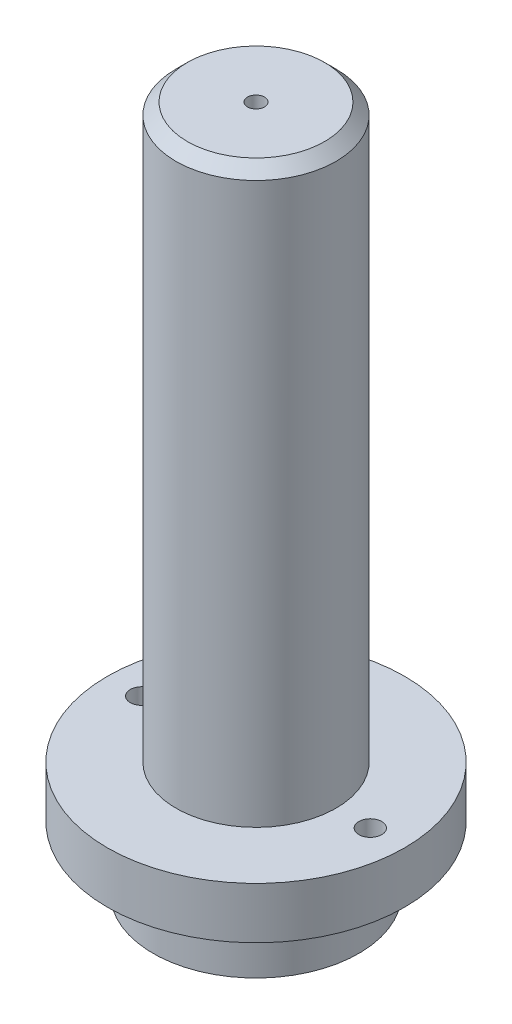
ISO-10303-21;
HEADER;
FILE_DESCRIPTION(('STEP AP214'),'2;1');
FILE_NAME('part.step','',(''),(''),'','','');
FILE_SCHEMA(('AUTOMOTIVE_DESIGN { 1 0 10303 214 1 1 1 1 }'));
ENDSEC;
DATA;
#1=APPLICATION_CONTEXT('core data for automotive mechanical design processes');
#2=APPLICATION_PROTOCOL_DEFINITION('international standard','automotive_design',2000,#1);
#3=PRODUCT_CONTEXT('',#1,'mechanical');
#4=PRODUCT('Part','Part','',(#3));
#5=PRODUCT_RELATED_PRODUCT_CATEGORY('part','',(#4));
#6=PRODUCT_DEFINITION_FORMATION('','',#4);
#7=PRODUCT_DEFINITION_CONTEXT('part definition',#1,'design');
#8=PRODUCT_DEFINITION('design','',#6,#7);
#9=PRODUCT_DEFINITION_SHAPE('','',#8);
#10=(LENGTH_UNIT() NAMED_UNIT(*) SI_UNIT(.MILLI.,.METRE.));
#11=(NAMED_UNIT(*) PLANE_ANGLE_UNIT() SI_UNIT($,.RADIAN.));
#12=(NAMED_UNIT(*) SI_UNIT($,.STERADIAN.) SOLID_ANGLE_UNIT());
#13=UNCERTAINTY_MEASURE_WITH_UNIT(LENGTH_MEASURE(1.E-05),#10,'distance_accuracy_value','');
#14=(GEOMETRIC_REPRESENTATION_CONTEXT(3) GLOBAL_UNCERTAINTY_ASSIGNED_CONTEXT((#13)) GLOBAL_UNIT_ASSIGNED_CONTEXT((#10,
#11,#12)) REPRESENTATION_CONTEXT('',''));
#15=CARTESIAN_POINT('',(0.,0.,0.));
#16=DIRECTION('',(0.,0.,1.));
#17=DIRECTION('',(1.,0.,0.));
#18=AXIS2_PLACEMENT_3D('',#15,#16,#17);
#19=CARTESIAN_POINT('',(0.,0.,0.));
#20=DIRECTION('',(0.,-1.,0.));
#21=DIRECTION('',(0.,0.,-1.));
#22=AXIS2_PLACEMENT_3D('',#19,#20,#21);
#23=PLANE('',#22);
#24=CARTESIAN_POINT('',(0.,0.,0.));
#25=DIRECTION('',(0.,-1.,0.));
#26=DIRECTION('',(0.,0.,-1.));
#27=AXIS2_PLACEMENT_3D('',#24,#25,#26);
#28=CIRCLE('',#27,5.5);
#29=CARTESIAN_POINT('',(0.,0.,-5.5));
#30=VERTEX_POINT('',#29);
#31=EDGE_CURVE('E86',#30,#30,#28,.T.);
#32=ORIENTED_EDGE('',*,*,#31,.F.);
#33=EDGE_LOOP('',(#32));
#34=FACE_BOUND('',#33,.T.);
#35=CARTESIAN_POINT('',(0.,0.,0.));
#36=DIRECTION('',(0.,-1.,0.));
#37=DIRECTION('',(0.,0.,-1.));
#38=AXIS2_PLACEMENT_3D('',#35,#36,#37);
#39=CIRCLE('',#38,9.);
#40=CARTESIAN_POINT('',(0.,0.,-9.));
#41=VERTEX_POINT('',#40);
#42=EDGE_CURVE('E101',#41,#41,#39,.T.);
#43=ORIENTED_EDGE('',*,*,#42,.T.);
#44=EDGE_LOOP('',(#43));
#45=FACE_BOUND('',#44,.T.);
#46=ADVANCED_FACE('F31',(#34,#45),#23,.T.);
#47=CARTESIAN_POINT('',(0.,-16.6647208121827,0.));
#48=DIRECTION('',(0.,-1.,0.));
#49=DIRECTION('',(0.,0.,-1.));
#50=AXIS2_PLACEMENT_3D('',#47,#48,#49);
#51=CYLINDRICAL_SURFACE('',#50,9.);
#52=CARTESIAN_POINT('',(0.,5.5,0.));
#53=DIRECTION('',(0.,-1.,0.));
#54=DIRECTION('',(0.,0.,-1.));
#55=AXIS2_PLACEMENT_3D('',#52,#53,#54);
#56=CIRCLE('',#55,9.);
#57=CARTESIAN_POINT('',(0.,5.5,-9.));
#58=VERTEX_POINT('',#57);
#59=EDGE_CURVE('E98',#58,#58,#56,.T.);
#60=ORIENTED_EDGE('',*,*,#59,.T.);
#61=EDGE_LOOP('',(#60));
#62=FACE_BOUND('',#61,.T.);
#63=ORIENTED_EDGE('',*,*,#42,.F.);
#64=EDGE_LOOP('',(#63));
#65=FACE_BOUND('',#64,.T.);
#66=ADVANCED_FACE('F119',(#62,#65),#51,.T.);
#67=CARTESIAN_POINT('',(9.,5.5,0.));
#68=DIRECTION('',(0.,-1.,0.));
#69=DIRECTION('',(0.,0.,-1.));
#70=AXIS2_PLACEMENT_3D('',#67,#68,#69);
#71=PLANE('',#70);
#72=CARTESIAN_POINT('',(0.,5.5,0.));
#73=DIRECTION('',(0.,-1.,0.));
#74=DIRECTION('',(0.,0.,-1.));
#75=AXIS2_PLACEMENT_3D('',#72,#73,#74);
#76=CIRCLE('',#75,13.);
#77=CARTESIAN_POINT('',(0.,5.5,-13.));
#78=VERTEX_POINT('',#77);
#79=EDGE_CURVE('E95',#78,#78,#76,.T.);
#80=ORIENTED_EDGE('',*,*,#79,.T.);
#81=EDGE_LOOP('',(#80));
#82=FACE_BOUND('',#81,.T.);
#83=ORIENTED_EDGE('',*,*,#59,.F.);
#84=EDGE_LOOP('',(#83));
#85=FACE_BOUND('',#84,.T.);
#86=ADVANCED_FACE('F124',(#82,#85),#71,.T.);
#87=CARTESIAN_POINT('',(0.,-16.6647208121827,0.));
#88=DIRECTION('',(0.,-1.,0.));
#89=DIRECTION('',(0.,0.,-1.));
#90=AXIS2_PLACEMENT_3D('',#87,#88,#89);
#91=CYLINDRICAL_SURFACE('',#90,13.);
#92=CARTESIAN_POINT('',(0.,10.,0.));
#93=DIRECTION('',(0.,-1.,0.));
#94=DIRECTION('',(0.,0.,-1.));
#95=AXIS2_PLACEMENT_3D('',#92,#93,#94);
#96=CIRCLE('',#95,13.);
#97=CARTESIAN_POINT('',(0.,10.,-13.));
#98=VERTEX_POINT('',#97);
#99=EDGE_CURVE('E92',#98,#98,#96,.T.);
#100=ORIENTED_EDGE('',*,*,#99,.T.);
#101=EDGE_LOOP('',(#100));
#102=FACE_BOUND('',#101,.T.);
#103=ORIENTED_EDGE('',*,*,#79,.F.);
#104=EDGE_LOOP('',(#103));
#105=FACE_BOUND('',#104,.T.);
#106=ADVANCED_FACE('F154',(#102,#105),#91,.T.);
#107=CARTESIAN_POINT('',(13.,10.,0.));
#108=DIRECTION('',(0.,1.,0.));
#109=DIRECTION('',(0.,0.,1.));
#110=AXIS2_PLACEMENT_3D('',#107,#108,#109);
#111=PLANE('',#110);
#112=CARTESIAN_POINT('',(-10.,10.,0.));
#113=DIRECTION('',(0.,1.,0.));
#114=DIRECTION('',(0.,0.,1.));
#115=AXIS2_PLACEMENT_3D('',#112,#113,#114);
#116=CIRCLE('',#115,1.);
#117=CARTESIAN_POINT('',(-10.,10.,1.));
#118=VERTEX_POINT('',#117);
#119=EDGE_CURVE('E55',#118,#118,#116,.T.);
#120=ORIENTED_EDGE('',*,*,#119,.F.);
#121=EDGE_LOOP('',(#120));
#122=FACE_BOUND('',#121,.T.);
#123=CARTESIAN_POINT('',(10.,10.,0.));
#124=DIRECTION('',(0.,1.,0.));
#125=DIRECTION('',(0.,0.,1.));
#126=AXIS2_PLACEMENT_3D('',#123,#124,#125);
#127=CIRCLE('',#126,1.);
#128=CARTESIAN_POINT('',(10.,10.,1.));
#129=VERTEX_POINT('',#128);
#130=EDGE_CURVE('E54',#129,#129,#127,.T.);
#131=ORIENTED_EDGE('',*,*,#130,.F.);
#132=EDGE_LOOP('',(#131));
#133=FACE_BOUND('',#132,.T.);
#134=CARTESIAN_POINT('',(0.,10.,0.));
#135=DIRECTION('',(0.,-1.,0.));
#136=DIRECTION('',(0.,0.,-1.));
#137=AXIS2_PLACEMENT_3D('',#134,#135,#136);
#138=CIRCLE('',#137,7.);
#139=CARTESIAN_POINT('',(0.,10.,-7.));
#140=VERTEX_POINT('',#139);
#141=EDGE_CURVE('E89',#140,#140,#138,.T.);
#142=ORIENTED_EDGE('',*,*,#141,.T.);
#143=EDGE_LOOP('',(#142));
#144=FACE_BOUND('',#143,.T.);
#145=ORIENTED_EDGE('',*,*,#99,.F.);
#146=EDGE_LOOP('',(#145));
#147=FACE_BOUND('',#146,.T.);
#148=ADVANCED_FACE('F151',(#122,#133,#144,#147),#111,.T.);
#149=CARTESIAN_POINT('',(0.,-16.6647208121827,0.));
#150=DIRECTION('',(0.,-1.,0.));
#151=DIRECTION('',(0.,0.,-1.));
#152=AXIS2_PLACEMENT_3D('',#149,#150,#151);
#153=CYLINDRICAL_SURFACE('',#152,7.);
#154=CARTESIAN_POINT('',(0.,59.,0.));
#155=DIRECTION('',(0.,1.,0.));
#156=DIRECTION('',(0.,0.,1.));
#157=AXIS2_PLACEMENT_3D('',#154,#155,#156);
#158=CIRCLE('',#157,7.);
#159=CARTESIAN_POINT('',(0.,59.,7.));
#160=VERTEX_POINT('',#159);
#161=EDGE_CURVE('E38',#160,#160,#158,.F.);
#162=ORIENTED_EDGE('',*,*,#161,.T.);
#163=EDGE_LOOP('',(#162));
#164=FACE_BOUND('',#163,.T.);
#165=ORIENTED_EDGE('',*,*,#141,.F.);
#166=EDGE_LOOP('',(#165));
#167=FACE_BOUND('',#166,.T.);
#168=ADVANCED_FACE('F106',(#164,#167),#153,.T.);
#169=CARTESIAN_POINT('',(7.,60.,0.));
#170=DIRECTION('',(0.,1.,0.));
#171=DIRECTION('',(0.,0.,1.));
#172=AXIS2_PLACEMENT_3D('',#169,#170,#171);
#173=PLANE('',#172);
#174=CARTESIAN_POINT('',(0.,60.,0.));
#175=DIRECTION('',(0.,1.,0.));
#176=DIRECTION('',(0.,0.,1.));
#177=AXIS2_PLACEMENT_3D('',#174,#175,#176);
#178=CIRCLE('',#177,5.99999999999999);
#179=CARTESIAN_POINT('',(0.,60.,5.99999999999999));
#180=VERTEX_POINT('',#179);
#181=EDGE_CURVE('E11',#180,#180,#178,.T.);
#182=ORIENTED_EDGE('',*,*,#181,.T.);
#183=EDGE_LOOP('',(#182));
#184=FACE_BOUND('',#183,.T.);
#185=CARTESIAN_POINT('',(0.,60.,0.));
#186=DIRECTION('',(0.,-1.,0.));
#187=DIRECTION('',(0.,0.,-1.));
#188=AXIS2_PLACEMENT_3D('',#185,#186,#187);
#189=CIRCLE('',#188,0.750000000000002);
#190=CARTESIAN_POINT('',(0.,60.,-0.750000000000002));
#191=VERTEX_POINT('',#190);
#192=EDGE_CURVE('E65',#191,#191,#189,.T.);
#193=ORIENTED_EDGE('',*,*,#192,.T.);
#194=EDGE_LOOP('',(#193));
#195=FACE_BOUND('',#194,.T.);
#196=ADVANCED_FACE('F134',(#184,#195),#173,.T.);
#197=CARTESIAN_POINT('',(0.,-4.2974825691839,0.));
#198=DIRECTION('',(0.,-1.,0.));
#199=DIRECTION('',(0.,0.,-1.));
#200=AXIS2_PLACEMENT_3D('',#197,#198,#199);
#201=CYLINDRICAL_SURFACE('',#200,5.5);
#202=CARTESIAN_POINT('',(0.,6.5,0.));
#203=DIRECTION('',(0.,-1.,0.));
#204=DIRECTION('',(0.,0.,-1.));
#205=AXIS2_PLACEMENT_3D('',#202,#203,#204);
#206=CIRCLE('',#205,5.5);
#207=CARTESIAN_POINT('',(0.,6.5,-5.5));
#208=VERTEX_POINT('',#207);
#209=EDGE_CURVE('E83',#208,#208,#206,.T.);
#210=ORIENTED_EDGE('',*,*,#209,.F.);
#211=EDGE_LOOP('',(#210));
#212=FACE_BOUND('',#211,.T.);
#213=ORIENTED_EDGE('',*,*,#31,.T.);
#214=EDGE_LOOP('',(#213));
#215=FACE_BOUND('',#214,.T.);
#216=ADVANCED_FACE('F131',(#212,#215),#201,.F.);
#217=CARTESIAN_POINT('',(5.5,6.5,0.));
#218=DIRECTION('',(0.,1.,0.));
#219=DIRECTION('',(0.,0.,1.));
#220=AXIS2_PLACEMENT_3D('',#217,#218,#219);
#221=PLANE('',#220);
#222=CARTESIAN_POINT('',(0.,6.5,0.));
#223=DIRECTION('',(0.,-1.,0.));
#224=DIRECTION('',(0.,0.,-1.));
#225=AXIS2_PLACEMENT_3D('',#222,#223,#224);
#226=CIRCLE('',#225,4.25000000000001);
#227=CARTESIAN_POINT('',(0.,6.5,-4.25000000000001));
#228=VERTEX_POINT('',#227);
#229=EDGE_CURVE('E80',#228,#228,#226,.T.);
#230=ORIENTED_EDGE('',*,*,#229,.F.);
#231=EDGE_LOOP('',(#230));
#232=FACE_BOUND('',#231,.T.);
#233=ORIENTED_EDGE('',*,*,#209,.T.);
#234=EDGE_LOOP('',(#233));
#235=FACE_BOUND('',#234,.T.);
#236=ADVANCED_FACE('F133',(#232,#235),#221,.F.);
#237=CARTESIAN_POINT('',(0.,-4.2974825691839,0.));
#238=DIRECTION('',(0.,-1.,0.));
#239=DIRECTION('',(0.,0.,-1.));
#240=AXIS2_PLACEMENT_3D('',#237,#238,#239);
#241=CYLINDRICAL_SURFACE('',#240,4.25000000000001);
#242=CARTESIAN_POINT('',(0.,8.5,0.));
#243=DIRECTION('',(0.,-1.,0.));
#244=DIRECTION('',(0.,0.,-1.));
#245=AXIS2_PLACEMENT_3D('',#242,#243,#244);
#246=CIRCLE('',#245,4.25000000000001);
#247=CARTESIAN_POINT('',(0.,8.5,-4.25000000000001));
#248=VERTEX_POINT('',#247);
#249=EDGE_CURVE('E77',#248,#248,#246,.T.);
#250=ORIENTED_EDGE('',*,*,#249,.F.);
#251=EDGE_LOOP('',(#250));
#252=FACE_BOUND('',#251,.T.);
#253=ORIENTED_EDGE('',*,*,#229,.T.);
#254=EDGE_LOOP('',(#253));
#255=FACE_BOUND('',#254,.T.);
#256=ADVANCED_FACE('F141',(#252,#255),#241,.F.);
#257=CARTESIAN_POINT('',(4.25000000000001,8.5,0.));
#258=DIRECTION('',(0.,-1.,0.));
#259=DIRECTION('',(0.,0.,-1.));
#260=AXIS2_PLACEMENT_3D('',#257,#258,#259);
#261=PLANE('',#260);
#262=CARTESIAN_POINT('',(0.,8.5,0.));
#263=DIRECTION('',(0.,-1.,0.));
#264=DIRECTION('',(0.,0.,-1.));
#265=AXIS2_PLACEMENT_3D('',#262,#263,#264);
#266=CIRCLE('',#265,5.50000000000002);
#267=CARTESIAN_POINT('',(0.,8.5,-5.50000000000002));
#268=VERTEX_POINT('',#267);
#269=EDGE_CURVE('E74',#268,#268,#266,.T.);
#270=ORIENTED_EDGE('',*,*,#269,.F.);
#271=EDGE_LOOP('',(#270));
#272=FACE_BOUND('',#271,.T.);
#273=ORIENTED_EDGE('',*,*,#249,.T.);
#274=EDGE_LOOP('',(#273));
#275=FACE_BOUND('',#274,.T.);
#276=ADVANCED_FACE('F200',(#272,#275),#261,.F.);
#277=CARTESIAN_POINT('',(0.,-4.2974825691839,0.));
#278=DIRECTION('',(0.,-1.,0.));
#279=DIRECTION('',(0.,0.,-1.));
#280=AXIS2_PLACEMENT_3D('',#277,#278,#279);
#281=CYLINDRICAL_SURFACE('',#280,5.50000000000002);
#282=CARTESIAN_POINT('',(0.,41.,0.));
#283=DIRECTION('',(0.,-1.,0.));
#284=DIRECTION('',(0.,0.,-1.));
#285=AXIS2_PLACEMENT_3D('',#282,#283,#284);
#286=CIRCLE('',#285,5.50000000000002);
#287=CARTESIAN_POINT('',(0.,41.,-5.50000000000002));
#288=VERTEX_POINT('',#287);
#289=EDGE_CURVE('E71',#288,#288,#286,.T.);
#290=ORIENTED_EDGE('',*,*,#289,.F.);
#291=EDGE_LOOP('',(#290));
#292=FACE_BOUND('',#291,.T.);
#293=ORIENTED_EDGE('',*,*,#269,.T.);
#294=EDGE_LOOP('',(#293));
#295=FACE_BOUND('',#294,.T.);
#296=ADVANCED_FACE('F207',(#292,#295),#281,.F.);
#297=CARTESIAN_POINT('',(5.50000000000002,41.,0.));
#298=DIRECTION('',(0.,1.,0.));
#299=DIRECTION('',(0.,0.,1.));
#300=AXIS2_PLACEMENT_3D('',#297,#298,#299);
#301=PLANE('',#300);
#302=CARTESIAN_POINT('',(0.,41.,0.));
#303=DIRECTION('',(0.,-1.,0.));
#304=DIRECTION('',(0.,0.,-1.));
#305=AXIS2_PLACEMENT_3D('',#302,#303,#304);
#306=CIRCLE('',#305,0.750000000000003);
#307=CARTESIAN_POINT('',(0.,41.,-0.750000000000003));
#308=VERTEX_POINT('',#307);
#309=EDGE_CURVE('E68',#308,#308,#306,.T.);
#310=ORIENTED_EDGE('',*,*,#309,.F.);
#311=EDGE_LOOP('',(#310));
#312=FACE_BOUND('',#311,.T.);
#313=ORIENTED_EDGE('',*,*,#289,.T.);
#314=EDGE_LOOP('',(#313));
#315=FACE_BOUND('',#314,.T.);
#316=ADVANCED_FACE('F215',(#312,#315),#301,.F.);
#317=CARTESIAN_POINT('',(0.,-4.2974825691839,0.));
#318=DIRECTION('',(0.,-1.,0.));
#319=DIRECTION('',(0.,0.,-1.));
#320=AXIS2_PLACEMENT_3D('',#317,#318,#319);
#321=CYLINDRICAL_SURFACE('',#320,0.750000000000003);
#322=ORIENTED_EDGE('',*,*,#192,.F.);
#323=EDGE_LOOP('',(#322));
#324=FACE_BOUND('',#323,.T.);
#325=ORIENTED_EDGE('',*,*,#309,.T.);
#326=EDGE_LOOP('',(#325));
#327=FACE_BOUND('',#326,.T.);
#328=ADVANCED_FACE('F223',(#324,#327),#321,.F.);
#329=CARTESIAN_POINT('',(10.,8.5,0.));
#330=DIRECTION('',(0.,1.,0.));
#331=DIRECTION('',(0.,0.,1.));
#332=AXIS2_PLACEMENT_3D('',#329,#330,#331);
#333=CONICAL_SURFACE('',#332,0.999999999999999,1.02974425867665);
#334=CARTESIAN_POINT('',(10.,7.89913938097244,0.));
#335=VERTEX_POINT('',#334);
#336=VERTEX_LOOP('',#335);
#337=FACE_BOUND('',#336,.T.);
#338=CARTESIAN_POINT('',(10.,8.5,0.));
#339=DIRECTION('',(0.,1.,0.));
#340=DIRECTION('',(0.,0.,1.));
#341=AXIS2_PLACEMENT_3D('',#338,#339,#340);
#342=CIRCLE('',#341,0.999999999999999);
#343=CARTESIAN_POINT('',(10.,8.5,0.999999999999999));
#344=VERTEX_POINT('',#343);
#345=EDGE_CURVE('E58',#344,#344,#342,.T.);
#346=ORIENTED_EDGE('',*,*,#345,.T.);
#347=EDGE_LOOP('',(#346));
#348=FACE_BOUND('',#347,.T.);
#349=ADVANCED_FACE('F231',(#337,#348),#333,.F.);
#350=CARTESIAN_POINT('',(10.,10.,0.));
#351=DIRECTION('',(0.,1.,0.));
#352=DIRECTION('',(0.,0.,1.));
#353=AXIS2_PLACEMENT_3D('',#350,#351,#352);
#354=CYLINDRICAL_SURFACE('',#353,1.);
#355=ORIENTED_EDGE('',*,*,#345,.F.);
#356=EDGE_LOOP('',(#355));
#357=FACE_BOUND('',#356,.T.);
#358=ORIENTED_EDGE('',*,*,#130,.T.);
#359=EDGE_LOOP('',(#358));
#360=FACE_BOUND('',#359,.T.);
#361=ADVANCED_FACE('F48',(#357,#360),#354,.F.);
#362=CARTESIAN_POINT('',(-10.,8.5,0.));
#363=DIRECTION('',(0.,1.,0.));
#364=DIRECTION('',(0.,0.,1.));
#365=AXIS2_PLACEMENT_3D('',#362,#363,#364);
#366=CONICAL_SURFACE('',#365,0.999999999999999,1.02974425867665);
#367=CARTESIAN_POINT('',(-10.,7.89913938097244,0.));
#368=VERTEX_POINT('',#367);
#369=VERTEX_LOOP('',#368);
#370=FACE_BOUND('',#369,.T.);
#371=CARTESIAN_POINT('',(-10.,8.5,0.));
#372=DIRECTION('',(0.,1.,0.));
#373=DIRECTION('',(0.,0.,1.));
#374=AXIS2_PLACEMENT_3D('',#371,#372,#373);
#375=CIRCLE('',#374,0.999999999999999);
#376=CARTESIAN_POINT('',(-10.,8.5,0.999999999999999));
#377=VERTEX_POINT('',#376);
#378=EDGE_CURVE('E52',#377,#377,#375,.T.);
#379=ORIENTED_EDGE('',*,*,#378,.T.);
#380=EDGE_LOOP('',(#379));
#381=FACE_BOUND('',#380,.T.);
#382=ADVANCED_FACE('F44',(#370,#381),#366,.F.);
#383=CARTESIAN_POINT('',(-10.,10.,0.));
#384=DIRECTION('',(0.,1.,0.));
#385=DIRECTION('',(0.,0.,1.));
#386=AXIS2_PLACEMENT_3D('',#383,#384,#385);
#387=CYLINDRICAL_SURFACE('',#386,1.);
#388=ORIENTED_EDGE('',*,*,#378,.F.);
#389=EDGE_LOOP('',(#388));
#390=FACE_BOUND('',#389,.T.);
#391=ORIENTED_EDGE('',*,*,#119,.T.);
#392=EDGE_LOOP('',(#391));
#393=FACE_BOUND('',#392,.T.);
#394=ADVANCED_FACE('F47',(#390,#393),#387,.F.);
#395=CARTESIAN_POINT('',(0.,59.,0.));
#396=DIRECTION('',(0.,-1.,0.));
#397=DIRECTION('',(0.,0.,-1.));
#398=AXIS2_PLACEMENT_3D('',#395,#396,#397);
#399=CONICAL_SURFACE('',#398,7.,0.785398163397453);
#400=ORIENTED_EDGE('',*,*,#181,.F.);
#401=EDGE_LOOP('',(#400));
#402=FACE_BOUND('',#401,.T.);
#403=ORIENTED_EDGE('',*,*,#161,.F.);
#404=EDGE_LOOP('',(#403));
#405=FACE_BOUND('',#404,.T.);
#406=ADVANCED_FACE('F109',(#402,#405),#399,.T.);
#407=CLOSED_SHELL('',(#46,#66,#86,#106,#148,#168,#196,#216,#236,#256,#276,#296,#316,#328,#349,
#361,#382,#394,#406));
#408=MANIFOLD_SOLID_BREP('B2',#407);
#409=ADVANCED_BREP_SHAPE_REPRESENTATION('',(#18,#408),#14);
#410=SHAPE_DEFINITION_REPRESENTATION(#9,#409);
ENDSEC;
END-ISO-10303-21;
